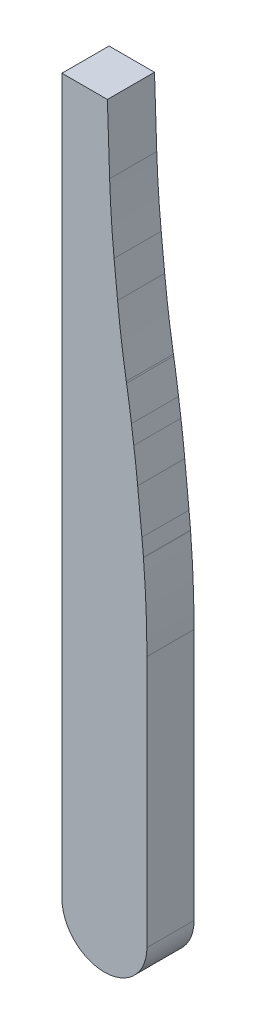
ISO-10303-21;
HEADER;
FILE_DESCRIPTION(('STEP AP214'),'2;1');
FILE_NAME('part.step','',(''),(''),'','','');
FILE_SCHEMA(('AUTOMOTIVE_DESIGN { 1 0 10303 214 1 1 1 1 }'));
ENDSEC;
DATA;
#1=APPLICATION_CONTEXT('core data for automotive mechanical design processes');
#2=APPLICATION_PROTOCOL_DEFINITION('international standard','automotive_design',2000,#1);
#3=PRODUCT_CONTEXT('',#1,'mechanical');
#4=PRODUCT('Part','Part','',(#3));
#5=PRODUCT_RELATED_PRODUCT_CATEGORY('part','',(#4));
#6=PRODUCT_DEFINITION_FORMATION('','',#4);
#7=PRODUCT_DEFINITION_CONTEXT('part definition',#1,'design');
#8=PRODUCT_DEFINITION('design','',#6,#7);
#9=PRODUCT_DEFINITION_SHAPE('','',#8);
#10=(LENGTH_UNIT() NAMED_UNIT(*) SI_UNIT(.MILLI.,.METRE.));
#11=(NAMED_UNIT(*) PLANE_ANGLE_UNIT() SI_UNIT($,.RADIAN.));
#12=(NAMED_UNIT(*) SI_UNIT($,.STERADIAN.) SOLID_ANGLE_UNIT());
#13=UNCERTAINTY_MEASURE_WITH_UNIT(LENGTH_MEASURE(1.E-05),#10,'distance_accuracy_value','');
#14=(GEOMETRIC_REPRESENTATION_CONTEXT(3) GLOBAL_UNCERTAINTY_ASSIGNED_CONTEXT((#13)) GLOBAL_UNIT_ASSIGNED_CONTEXT((#10,
#11,#12)) REPRESENTATION_CONTEXT('',''));
#15=CARTESIAN_POINT('',(0.,0.,0.));
#16=DIRECTION('',(0.,0.,1.));
#17=DIRECTION('',(1.,0.,0.));
#18=AXIS2_PLACEMENT_3D('',#15,#16,#17);
#19=CARTESIAN_POINT('',(-13.5,-200.065547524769,28.));
#20=DIRECTION('',(1.,0.,0.));
#21=DIRECTION('',(0.,0.,-1.));
#22=AXIS2_PLACEMENT_3D('',#19,#20,#21);
#23=PLANE('',#22);
#24=DIRECTION('',(0.,-1.,0.));
#25=VECTOR('',#24,1.);
#26=CARTESIAN_POINT('',(-13.5,-200.065547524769,0.));
#27=LINE('',#26,#25);
#28=CARTESIAN_POINT('',(-13.5,224.684452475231,0.));
#29=VERTEX_POINT('',#28);
#30=CARTESIAN_POINT('',(-13.5,-200.065547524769,0.));
#31=VERTEX_POINT('',#30);
#32=EDGE_CURVE('E170',#29,#31,#27,.T.);
#33=ORIENTED_EDGE('',*,*,#32,.T.);
#34=DIRECTION('',(0.,0.,-1.));
#35=VECTOR('',#34,1.);
#36=CARTESIAN_POINT('',(-13.5,-200.065547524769,28.));
#37=LINE('',#36,#35);
#38=CARTESIAN_POINT('',(-13.5,-200.065547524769,28.));
#39=VERTEX_POINT('',#38);
#40=EDGE_CURVE('E150',#39,#31,#37,.T.);
#41=ORIENTED_EDGE('',*,*,#40,.F.);
#42=DIRECTION('',(0.,-1.,0.));
#43=VECTOR('',#42,1.);
#44=CARTESIAN_POINT('',(-13.5,-200.065547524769,28.));
#45=LINE('',#44,#43);
#46=CARTESIAN_POINT('',(-13.5,224.684452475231,28.));
#47=VERTEX_POINT('',#46);
#48=EDGE_CURVE('E157',#47,#39,#45,.T.);
#49=ORIENTED_EDGE('',*,*,#48,.F.);
#50=DIRECTION('',(0.,0.,-1.));
#51=VECTOR('',#50,1.);
#52=CARTESIAN_POINT('',(-13.5,224.684452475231,28.));
#53=LINE('',#52,#51);
#54=EDGE_CURVE('E252',#47,#29,#53,.T.);
#55=ORIENTED_EDGE('',*,*,#54,.T.);
#56=EDGE_LOOP('',(#33,#41,#49,#55));
#57=FACE_BOUND('',#56,.T.);
#58=ADVANCED_FACE('F32',(#57),#23,.F.);
#59=CARTESIAN_POINT('',(11.75,-200.065547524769,28.));
#60=DIRECTION('',(0.,0.,-1.));
#61=DIRECTION('',(-1.,0.,0.));
#62=AXIS2_PLACEMENT_3D('',#59,#60,#61);
#63=CYLINDRICAL_SURFACE('',#62,25.25);
#64=CARTESIAN_POINT('',(11.75,-200.065547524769,0.));
#65=DIRECTION('',(0.,0.,1.));
#66=DIRECTION('',(1.,0.,0.));
#67=AXIS2_PLACEMENT_3D('',#64,#65,#66);
#68=CIRCLE('',#67,25.25);
#69=CARTESIAN_POINT('',(37.,-200.065547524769,0.));
#70=VERTEX_POINT('',#69);
#71=EDGE_CURVE('E259',#31,#70,#68,.T.);
#72=ORIENTED_EDGE('',*,*,#71,.T.);
#73=DIRECTION('',(0.,0.,-1.));
#74=VECTOR('',#73,1.);
#75=CARTESIAN_POINT('',(37.,-200.065547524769,28.));
#76=LINE('',#75,#74);
#77=CARTESIAN_POINT('',(37.,-200.065547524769,28.));
#78=VERTEX_POINT('',#77);
#79=EDGE_CURVE('E153',#78,#70,#76,.T.);
#80=ORIENTED_EDGE('',*,*,#79,.F.);
#81=CARTESIAN_POINT('',(11.75,-200.065547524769,28.));
#82=DIRECTION('',(0.,0.,1.));
#83=DIRECTION('',(1.,0.,0.));
#84=AXIS2_PLACEMENT_3D('',#81,#82,#83);
#85=CIRCLE('',#84,25.25);
#86=EDGE_CURVE('E146',#39,#78,#85,.T.);
#87=ORIENTED_EDGE('',*,*,#86,.F.);
#88=ORIENTED_EDGE('',*,*,#40,.T.);
#89=EDGE_LOOP('',(#72,#80,#87,#88));
#90=FACE_BOUND('',#89,.T.);
#91=ADVANCED_FACE('F148',(#90),#63,.T.);
#92=CARTESIAN_POINT('',(37.,-200.065547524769,28.));
#93=DIRECTION('',(-1.,0.,0.));
#94=DIRECTION('',(0.,0.,1.));
#95=AXIS2_PLACEMENT_3D('',#92,#93,#94);
#96=PLANE('',#95);
#97=DIRECTION('',(0.,1.,0.));
#98=VECTOR('',#97,1.);
#99=CARTESIAN_POINT('',(37.,-200.065547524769,0.));
#100=LINE('',#99,#98);
#101=CARTESIAN_POINT('',(37.,-50.2722948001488,0.));
#102=VERTEX_POINT('',#101);
#103=EDGE_CURVE('E261',#70,#102,#100,.T.);
#104=ORIENTED_EDGE('',*,*,#103,.T.);
#105=DIRECTION('',(0.,0.,-1.));
#106=VECTOR('',#105,1.);
#107=CARTESIAN_POINT('',(37.,-50.2722948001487,28.));
#108=LINE('',#107,#106);
#109=CARTESIAN_POINT('',(37.,-50.2722948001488,28.));
#110=VERTEX_POINT('',#109);
#111=EDGE_CURVE('E218',#102,#110,#108,.F.);
#112=ORIENTED_EDGE('',*,*,#111,.T.);
#113=DIRECTION('',(0.,1.,0.));
#114=VECTOR('',#113,1.);
#115=CARTESIAN_POINT('',(37.,-200.065547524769,28.));
#116=LINE('',#115,#114);
#117=EDGE_CURVE('E156',#78,#110,#116,.T.);
#118=ORIENTED_EDGE('',*,*,#117,.F.);
#119=ORIENTED_EDGE('',*,*,#79,.T.);
#120=EDGE_LOOP('',(#104,#112,#118,#119));
#121=FACE_BOUND('',#120,.T.);
#122=ADVANCED_FACE('F280',(#121),#96,.F.);
#123=CARTESIAN_POINT('',(34.5,4.68445247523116,28.));
#124=DIRECTION('',(-0.99654575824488,-0.0830454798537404,0.));
#125=DIRECTION('',(0.0830454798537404,-0.99654575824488,0.));
#126=AXIS2_PLACEMENT_3D('',#123,#124,#125);
#127=PLANE('',#126);
#128=DIRECTION('',(-0.0830454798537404,0.99654575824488,0.));
#129=VECTOR('',#128,1.);
#130=CARTESIAN_POINT('',(34.5,4.68445247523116,0.));
#131=LINE('',#130,#129);
#132=CARTESIAN_POINT('',(34.927454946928,-0.4450068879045,0.));
#133=VERTEX_POINT('',#132);
#134=CARTESIAN_POINT('',(34.9117676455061,-0.256759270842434,0.));
#135=VERTEX_POINT('',#134);
#136=EDGE_CURVE('E264',#133,#135,#131,.T.);
#137=ORIENTED_EDGE('',*,*,#136,.T.);
#138=DIRECTION('',(0.,0.,-1.));
#139=VECTOR('',#138,1.);
#140=CARTESIAN_POINT('',(34.9117676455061,-0.256759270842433,28.));
#141=LINE('',#140,#139);
#142=CARTESIAN_POINT('',(34.9117676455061,-0.256759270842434,28.));
#143=VERTEX_POINT('',#142);
#144=EDGE_CURVE('E216',#135,#143,#141,.F.);
#145=ORIENTED_EDGE('',*,*,#144,.T.);
#146=DIRECTION('',(-0.0830454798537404,0.99654575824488,0.));
#147=VECTOR('',#146,1.);
#148=CARTESIAN_POINT('',(34.5,4.68445247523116,28.));
#149=LINE('',#148,#147);
#150=CARTESIAN_POINT('',(34.927454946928,-0.4450068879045,28.));
#151=VERTEX_POINT('',#150);
#152=EDGE_CURVE('E283',#151,#143,#149,.T.);
#153=ORIENTED_EDGE('',*,*,#152,.F.);
#154=DIRECTION('',(0.,0.,-1.));
#155=VECTOR('',#154,1.);
#156=CARTESIAN_POINT('',(34.927454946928,-0.445006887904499,28.));
#157=LINE('',#156,#155);
#158=EDGE_CURVE('E213',#151,#133,#157,.T.);
#159=ORIENTED_EDGE('',*,*,#158,.T.);
#160=EDGE_LOOP('',(#137,#145,#153,#159));
#161=FACE_BOUND('',#160,.T.);
#162=ADVANCED_FACE('F319',(#161),#127,.F.);
#163=CARTESIAN_POINT('',(30.5,44.6844524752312,28.));
#164=DIRECTION('',(-0.995037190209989,-0.099503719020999,0.));
#165=DIRECTION('',(0.099503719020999,-0.995037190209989,0.));
#166=AXIS2_PLACEMENT_3D('',#163,#164,#165);
#167=PLANE('',#166);
#168=DIRECTION('',(-0.099503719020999,0.995037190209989,0.));
#169=VECTOR('',#168,1.);
#170=CARTESIAN_POINT('',(30.5,44.6844524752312,0.));
#171=LINE('',#170,#169);
#172=CARTESIAN_POINT('',(34.0066268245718,9.61818422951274,0.));
#173=VERTEX_POINT('',#172);
#174=CARTESIAN_POINT('',(31.4816791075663,34.8676613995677,0.));
#175=VERTEX_POINT('',#174);
#176=EDGE_CURVE('E267',#173,#175,#171,.T.);
#177=ORIENTED_EDGE('',*,*,#176,.T.);
#178=DIRECTION('',(0.,0.,-1.));
#179=VECTOR('',#178,1.);
#180=CARTESIAN_POINT('',(31.4816791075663,34.8676613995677,28.));
#181=LINE('',#180,#179);
#182=CARTESIAN_POINT('',(31.4816791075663,34.8676613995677,28.));
#183=VERTEX_POINT('',#182);
#184=EDGE_CURVE('E47',#175,#183,#181,.F.);
#185=ORIENTED_EDGE('',*,*,#184,.T.);
#186=DIRECTION('',(-0.099503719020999,0.995037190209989,0.));
#187=VECTOR('',#186,1.);
#188=CARTESIAN_POINT('',(30.5,44.6844524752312,28.));
#189=LINE('',#188,#187);
#190=CARTESIAN_POINT('',(34.0066268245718,9.61818422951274,28.));
#191=VERTEX_POINT('',#190);
#192=EDGE_CURVE('E285',#191,#183,#189,.T.);
#193=ORIENTED_EDGE('',*,*,#192,.F.);
#194=DIRECTION('',(0.,0.,-1.));
#195=VECTOR('',#194,1.);
#196=CARTESIAN_POINT('',(34.0066268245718,9.61818422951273,28.));
#197=LINE('',#196,#195);
#198=EDGE_CURVE('E209',#191,#173,#197,.T.);
#199=ORIENTED_EDGE('',*,*,#198,.T.);
#200=EDGE_LOOP('',(#177,#185,#193,#199));
#201=FACE_BOUND('',#200,.T.);
#202=ADVANCED_FACE('F312',(#201),#167,.F.);
#203=CARTESIAN_POINT('',(26.5,74.6844524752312,28.));
#204=DIRECTION('',(-0.991227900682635,-0.132163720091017,0.));
#205=DIRECTION('',(0.132163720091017,-0.991227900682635,0.));
#206=AXIS2_PLACEMENT_3D('',#203,#204,#205);
#207=PLANE('',#206);
#208=DIRECTION('',(-0.132163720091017,0.991227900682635,0.));
#209=VECTOR('',#208,1.);
#210=CARTESIAN_POINT('',(26.5,74.6844524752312,0.));
#211=LINE('',#210,#209);
#212=CARTESIAN_POINT('',(29.1961053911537,54.4636620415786,0.));
#213=VERTEX_POINT('',#212);
#214=CARTESIAN_POINT('',(27.7925624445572,64.9902341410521,0.));
#215=VERTEX_POINT('',#214);
#216=EDGE_CURVE('E269',#213,#215,#211,.T.);
#217=ORIENTED_EDGE('',*,*,#216,.T.);
#218=DIRECTION('',(0.,0.,-1.));
#219=VECTOR('',#218,1.);
#220=CARTESIAN_POINT('',(27.7925624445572,64.9902341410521,28.));
#221=LINE('',#220,#219);
#222=CARTESIAN_POINT('',(27.7925624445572,64.9902341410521,28.));
#223=VERTEX_POINT('',#222);
#224=EDGE_CURVE('E200',#215,#223,#221,.F.);
#225=ORIENTED_EDGE('',*,*,#224,.T.);
#226=DIRECTION('',(-0.132163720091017,0.991227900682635,0.));
#227=VECTOR('',#226,1.);
#228=CARTESIAN_POINT('',(26.5,74.6844524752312,28.));
#229=LINE('',#228,#227);
#230=CARTESIAN_POINT('',(29.1961053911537,54.4636620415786,28.));
#231=VERTEX_POINT('',#230);
#232=EDGE_CURVE('E289',#231,#223,#229,.T.);
#233=ORIENTED_EDGE('',*,*,#232,.F.);
#234=DIRECTION('',(0.,0.,-1.));
#235=VECTOR('',#234,1.);
#236=CARTESIAN_POINT('',(29.1961053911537,54.4636620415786,28.));
#237=LINE('',#236,#235);
#238=EDGE_CURVE('E197',#231,#213,#237,.T.);
#239=ORIENTED_EDGE('',*,*,#238,.T.);
#240=EDGE_LOOP('',(#217,#225,#233,#239));
#241=FACE_BOUND('',#240,.T.);
#242=ADVANCED_FACE('F305',(#241),#207,.F.);
#243=CARTESIAN_POINT('',(21.5,104.684452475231,28.));
#244=DIRECTION('',(-0.986393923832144,-0.164398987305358,0.));
#245=DIRECTION('',(0.164398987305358,-0.986393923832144,0.));
#246=AXIS2_PLACEMENT_3D('',#243,#244,#245);
#247=PLANE('',#246);
#248=DIRECTION('',(-0.164398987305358,0.986393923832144,0.));
#249=VECTOR('',#248,1.);
#250=CARTESIAN_POINT('',(21.5,104.684452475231,0.));
#251=LINE('',#250,#249);
#252=CARTESIAN_POINT('',(24.8921763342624,84.3313944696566,0.));
#253=VERTEX_POINT('',#252);
#254=CARTESIAN_POINT('',(24.7306093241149,85.3007965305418,0.));
#255=VERTEX_POINT('',#254);
#256=EDGE_CURVE('E240',#253,#255,#251,.T.);
#257=ORIENTED_EDGE('',*,*,#256,.T.);
#258=DIRECTION('',(0.,0.,-1.));
#259=VECTOR('',#258,1.);
#260=CARTESIAN_POINT('',(24.7306093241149,85.3007965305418,28.));
#261=LINE('',#260,#259);
#262=CARTESIAN_POINT('',(24.7306093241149,85.3007965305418,28.));
#263=VERTEX_POINT('',#262);
#264=EDGE_CURVE('E184',#255,#263,#261,.F.);
#265=ORIENTED_EDGE('',*,*,#264,.T.);
#266=DIRECTION('',(-0.164398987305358,0.986393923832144,0.));
#267=VECTOR('',#266,1.);
#268=CARTESIAN_POINT('',(21.5,104.684452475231,28.));
#269=LINE('',#268,#267);
#270=CARTESIAN_POINT('',(24.8921763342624,84.3313944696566,28.));
#271=VERTEX_POINT('',#270);
#272=EDGE_CURVE('E254',#271,#263,#269,.T.);
#273=ORIENTED_EDGE('',*,*,#272,.F.);
#274=DIRECTION('',(0.,0.,-1.));
#275=VECTOR('',#274,1.);
#276=CARTESIAN_POINT('',(24.8921763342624,84.3313944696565,28.));
#277=LINE('',#276,#275);
#278=EDGE_CURVE('E181',#271,#253,#277,.T.);
#279=ORIENTED_EDGE('',*,*,#278,.T.);
#280=EDGE_LOOP('',(#257,#265,#273,#279));
#281=FACE_BOUND('',#280,.T.);
#282=ADVANCED_FACE('F299',(#281),#247,.F.);
#283=CARTESIAN_POINT('',(15.5,164.684452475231,28.));
#284=DIRECTION('',(-0.995037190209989,-0.0995037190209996,0.));
#285=DIRECTION('',(0.0995037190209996,-0.995037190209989,0.));
#286=AXIS2_PLACEMENT_3D('',#283,#284,#285);
#287=PLANE('',#286);
#288=DIRECTION('',(-0.0995037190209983,0.995037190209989,0.));
#289=VECTOR('',#288,1.);
#290=CARTESIAN_POINT('',(18.5,134.684452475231,28.));
#291=LINE('',#290,#289);
#292=CARTESIAN_POINT('',(19.5446494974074,124.237957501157,28.));
#293=VERTEX_POINT('',#292);
#294=CARTESIAN_POINT('',(17.4812784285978,144.871668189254,28.));
#295=VERTEX_POINT('',#294);
#296=EDGE_CURVE('E247',#293,#295,#291,.T.);
#297=ORIENTED_EDGE('',*,*,#296,.F.);
#298=DIRECTION('',(0.,0.,-1.));
#299=VECTOR('',#298,1.);
#300=CARTESIAN_POINT('',(19.5446494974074,124.237957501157,0.));
#301=LINE('',#300,#299);
#302=CARTESIAN_POINT('',(19.5446494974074,124.237957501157,0.));
#303=VERTEX_POINT('',#302);
#304=EDGE_CURVE('E173',#293,#303,#301,.T.);
#305=ORIENTED_EDGE('',*,*,#304,.T.);
#306=DIRECTION('',(-0.0995037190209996,0.995037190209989,0.));
#307=VECTOR('',#306,1.);
#308=CARTESIAN_POINT('',(15.5,164.684452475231,0.));
#309=LINE('',#308,#307);
#310=CARTESIAN_POINT('',(17.4812784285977,144.871668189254,0.));
#311=VERTEX_POINT('',#310);
#312=EDGE_CURVE('E229',#303,#311,#309,.T.);
#313=ORIENTED_EDGE('',*,*,#312,.T.);
#314=DIRECTION('',(0.,0.,-1.));
#315=VECTOR('',#314,1.);
#316=CARTESIAN_POINT('',(17.4812784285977,144.871668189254,28.));
#317=LINE('',#316,#315);
#318=EDGE_CURVE('E171',#311,#295,#317,.F.);
#319=ORIENTED_EDGE('',*,*,#318,.T.);
#320=EDGE_LOOP('',(#297,#305,#313,#319));
#321=FACE_BOUND('',#320,.T.);
#322=ADVANCED_FACE('F237',(#321),#287,.F.);
#323=CARTESIAN_POINT('',(13.5,224.684452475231,28.));
#324=DIRECTION('',(-0.999444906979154,-0.0333148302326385,0.));
#325=DIRECTION('',(0.0333148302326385,-0.999444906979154,0.));
#326=AXIS2_PLACEMENT_3D('',#323,#324,#325);
#327=PLANE('',#326);
#328=DIRECTION('',(-0.0333148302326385,0.999444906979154,0.));
#329=VECTOR('',#328,1.);
#330=CARTESIAN_POINT('',(13.5,224.684452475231,28.));
#331=LINE('',#330,#329);
#332=CARTESIAN_POINT('',(14.8366483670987,184.58500146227,28.));
#333=VERTEX_POINT('',#332);
#334=CARTESIAN_POINT('',(13.5,224.684452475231,28.));
#335=VERTEX_POINT('',#334);
#336=EDGE_CURVE('E245',#333,#335,#331,.T.);
#337=ORIENTED_EDGE('',*,*,#336,.F.);
#338=DIRECTION('',(0.,0.,-1.));
#339=VECTOR('',#338,1.);
#340=CARTESIAN_POINT('',(14.8366483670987,184.58500146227,0.));
#341=LINE('',#340,#339);
#342=CARTESIAN_POINT('',(14.8366483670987,184.58500146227,0.));
#343=VERTEX_POINT('',#342);
#344=EDGE_CURVE('E186',#333,#343,#341,.T.);
#345=ORIENTED_EDGE('',*,*,#344,.T.);
#346=DIRECTION('',(-0.0333148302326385,0.999444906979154,0.));
#347=VECTOR('',#346,1.);
#348=CARTESIAN_POINT('',(13.5,224.684452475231,0.));
#349=LINE('',#348,#347);
#350=CARTESIAN_POINT('',(13.5,224.684452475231,0.));
#351=VERTEX_POINT('',#350);
#352=EDGE_CURVE('E231',#343,#351,#349,.T.);
#353=ORIENTED_EDGE('',*,*,#352,.T.);
#354=DIRECTION('',(0.,0.,-1.));
#355=VECTOR('',#354,1.);
#356=CARTESIAN_POINT('',(13.5,224.684452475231,28.));
#357=LINE('',#356,#355);
#358=EDGE_CURVE('E175',#335,#351,#357,.T.);
#359=ORIENTED_EDGE('',*,*,#358,.F.);
#360=EDGE_LOOP('',(#337,#345,#353,#359));
#361=FACE_BOUND('',#360,.T.);
#362=ADVANCED_FACE('F249',(#361),#327,.F.);
#363=CARTESIAN_POINT('',(13.5,224.684452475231,28.));
#364=DIRECTION('',(0.,-1.,0.));
#365=DIRECTION('',(0.,0.,-1.));
#366=AXIS2_PLACEMENT_3D('',#363,#364,#365);
#367=PLANE('',#366);
#368=DIRECTION('',(-1.,0.,0.));
#369=VECTOR('',#368,1.);
#370=CARTESIAN_POINT('',(13.5,224.684452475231,0.));
#371=LINE('',#370,#369);
#372=EDGE_CURVE('E167',#351,#29,#371,.T.);
#373=ORIENTED_EDGE('',*,*,#372,.T.);
#374=ORIENTED_EDGE('',*,*,#54,.F.);
#375=DIRECTION('',(-1.,0.,0.));
#376=VECTOR('',#375,1.);
#377=CARTESIAN_POINT('',(13.5,224.684452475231,28.));
#378=LINE('',#377,#376);
#379=EDGE_CURVE('E163',#335,#47,#378,.T.);
#380=ORIENTED_EDGE('',*,*,#379,.F.);
#381=ORIENTED_EDGE('',*,*,#358,.T.);
#382=EDGE_LOOP('',(#373,#374,#380,#381));
#383=FACE_BOUND('',#382,.T.);
#384=ADVANCED_FACE('F277',(#383),#367,.F.);
#385=CARTESIAN_POINT('',(11.75,-200.065547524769,28.));
#386=DIRECTION('',(0.,0.,1.));
#387=DIRECTION('',(1.,0.,0.));
#388=AXIS2_PLACEMENT_3D('',#385,#386,#387);
#389=PLANE('',#388);
#390=ORIENTED_EDGE('',*,*,#232,.T.);
#391=CARTESIAN_POINT('',(-566.944177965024,-14.3079979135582,28.));
#392=DIRECTION('',(0.,0.,1.));
#393=DIRECTION('',(1.,0.,0.));
#394=AXIS2_PLACEMENT_3D('',#391,#392,#393);
#395=CIRCLE('',#394,600.);
#396=EDGE_CURVE('E207',#223,#271,#395,.T.);
#397=ORIENTED_EDGE('',*,*,#396,.T.);
#398=ORIENTED_EDGE('',*,*,#272,.T.);
#399=CARTESIAN_POINT('',(616.566963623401,183.940188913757,28.));
#400=DIRECTION('',(0.,0.,1.));
#401=DIRECTION('',(1.,0.,0.));
#402=AXIS2_PLACEMENT_3D('',#399,#400,#401);
#403=CIRCLE('',#402,600.);
#404=EDGE_CURVE('E222',#263,#293,#403,.F.);
#405=ORIENTED_EDGE('',*,*,#404,.T.);
#406=ORIENTED_EDGE('',*,*,#296,.T.);
#407=CARTESIAN_POINT('',(614.503592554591,204.573899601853,28.));
#408=DIRECTION('',(0.,0.,1.));
#409=DIRECTION('',(1.,0.,0.));
#410=AXIS2_PLACEMENT_3D('',#407,#408,#409);
#411=CIRCLE('',#410,600.);
#412=EDGE_CURVE('E11',#295,#333,#411,.F.);
#413=ORIENTED_EDGE('',*,*,#412,.T.);
#414=ORIENTED_EDGE('',*,*,#336,.T.);
#415=ORIENTED_EDGE('',*,*,#379,.T.);
#416=ORIENTED_EDGE('',*,*,#48,.T.);
#417=ORIENTED_EDGE('',*,*,#86,.T.);
#418=ORIENTED_EDGE('',*,*,#117,.T.);
#419=CARTESIAN_POINT('',(-563.,-50.2722948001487,28.));
#420=DIRECTION('',(0.,0.,1.));
#421=DIRECTION('',(1.,0.,0.));
#422=AXIS2_PLACEMENT_3D('',#419,#420,#421);
#423=CIRCLE('',#422,600.);
#424=EDGE_CURVE('E202',#110,#151,#423,.T.);
#425=ORIENTED_EDGE('',*,*,#424,.T.);
#426=ORIENTED_EDGE('',*,*,#152,.T.);
#427=CARTESIAN_POINT('',(-563.015687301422,-50.0840471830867,28.));
#428=DIRECTION('',(0.,0.,1.));
#429=DIRECTION('',(1.,0.,0.));
#430=AXIS2_PLACEMENT_3D('',#427,#428,#429);
#431=CIRCLE('',#430,600.);
#432=EDGE_CURVE('E54',#143,#191,#431,.T.);
#433=ORIENTED_EDGE('',*,*,#432,.T.);
#434=ORIENTED_EDGE('',*,*,#192,.T.);
#435=CARTESIAN_POINT('',(-565.540635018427,-24.8345700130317,28.));
#436=DIRECTION('',(0.,0.,1.));
#437=DIRECTION('',(1.,0.,0.));
#438=AXIS2_PLACEMENT_3D('',#435,#436,#437);
#439=CIRCLE('',#438,600.);
#440=EDGE_CURVE('E205',#183,#231,#439,.T.);
#441=ORIENTED_EDGE('',*,*,#440,.T.);
#442=EDGE_LOOP('',(#390,#397,#398,#405,#406,#413,#414,#415,#416,#417,#418,#425,#426,#433,#434,#441));
#443=FACE_BOUND('',#442,.T.);
#444=ADVANCED_FACE('F161',(#443),#389,.T.);
#445=CARTESIAN_POINT('',(11.75,-200.065547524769,0.));
#446=DIRECTION('',(0.,0.,1.));
#447=DIRECTION('',(1.,0.,0.));
#448=AXIS2_PLACEMENT_3D('',#445,#446,#447);
#449=PLANE('',#448);
#450=ORIENTED_EDGE('',*,*,#256,.F.);
#451=CARTESIAN_POINT('',(-566.944177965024,-14.3079979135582,0.));
#452=DIRECTION('',(0.,0.,1.));
#453=DIRECTION('',(1.,0.,0.));
#454=AXIS2_PLACEMENT_3D('',#451,#452,#453);
#455=CIRCLE('',#454,600.);
#456=EDGE_CURVE('E195',#253,#215,#455,.F.);
#457=ORIENTED_EDGE('',*,*,#456,.T.);
#458=ORIENTED_EDGE('',*,*,#216,.F.);
#459=CARTESIAN_POINT('',(-565.540635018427,-24.8345700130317,0.));
#460=DIRECTION('',(0.,0.,1.));
#461=DIRECTION('',(1.,0.,0.));
#462=AXIS2_PLACEMENT_3D('',#459,#460,#461);
#463=CIRCLE('',#462,600.);
#464=EDGE_CURVE('E193',#213,#175,#463,.F.);
#465=ORIENTED_EDGE('',*,*,#464,.T.);
#466=ORIENTED_EDGE('',*,*,#176,.F.);
#467=CARTESIAN_POINT('',(-563.015687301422,-50.0840471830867,0.));
#468=DIRECTION('',(0.,0.,1.));
#469=DIRECTION('',(1.,0.,0.));
#470=AXIS2_PLACEMENT_3D('',#467,#468,#469);
#471=CIRCLE('',#470,600.);
#472=EDGE_CURVE('E191',#173,#135,#471,.F.);
#473=ORIENTED_EDGE('',*,*,#472,.T.);
#474=ORIENTED_EDGE('',*,*,#136,.F.);
#475=CARTESIAN_POINT('',(-563.,-50.2722948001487,0.));
#476=DIRECTION('',(0.,0.,1.));
#477=DIRECTION('',(1.,0.,0.));
#478=AXIS2_PLACEMENT_3D('',#475,#476,#477);
#479=CIRCLE('',#478,600.);
#480=EDGE_CURVE('E189',#133,#102,#479,.F.);
#481=ORIENTED_EDGE('',*,*,#480,.T.);
#482=ORIENTED_EDGE('',*,*,#103,.F.);
#483=ORIENTED_EDGE('',*,*,#71,.F.);
#484=ORIENTED_EDGE('',*,*,#32,.F.);
#485=ORIENTED_EDGE('',*,*,#372,.F.);
#486=ORIENTED_EDGE('',*,*,#352,.F.);
#487=CARTESIAN_POINT('',(614.503592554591,204.573899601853,0.));
#488=DIRECTION('',(0.,0.,1.));
#489=DIRECTION('',(1.,0.,0.));
#490=AXIS2_PLACEMENT_3D('',#487,#488,#489);
#491=CIRCLE('',#490,600.);
#492=EDGE_CURVE('E40',#343,#311,#491,.T.);
#493=ORIENTED_EDGE('',*,*,#492,.T.);
#494=ORIENTED_EDGE('',*,*,#312,.F.);
#495=CARTESIAN_POINT('',(616.566963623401,183.940188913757,0.));
#496=DIRECTION('',(0.,0.,1.));
#497=DIRECTION('',(1.,0.,0.));
#498=AXIS2_PLACEMENT_3D('',#495,#496,#497);
#499=CIRCLE('',#498,600.);
#500=EDGE_CURVE('E220',#303,#255,#499,.T.);
#501=ORIENTED_EDGE('',*,*,#500,.T.);
#502=EDGE_LOOP('',(#450,#457,#458,#465,#466,#473,#474,#481,#482,#483,#484,#485,#486,#493,#494,#501));
#503=FACE_BOUND('',#502,.T.);
#504=ADVANCED_FACE('F228',(#503),#449,.F.);
#505=CARTESIAN_POINT('',(616.566963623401,183.940188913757,28.));
#506=DIRECTION('',(0.,0.,1.));
#507=DIRECTION('',(1.,0.,0.));
#508=AXIS2_PLACEMENT_3D('',#505,#506,#507);
#509=CYLINDRICAL_SURFACE('',#508,600.);
#510=ORIENTED_EDGE('',*,*,#404,.F.);
#511=ORIENTED_EDGE('',*,*,#264,.F.);
#512=ORIENTED_EDGE('',*,*,#500,.F.);
#513=ORIENTED_EDGE('',*,*,#304,.F.);
#514=EDGE_LOOP('',(#510,#511,#512,#513));
#515=FACE_BOUND('',#514,.T.);
#516=ADVANCED_FACE('F298',(#515),#509,.F.);
#517=CARTESIAN_POINT('',(614.503592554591,204.573899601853,28.));
#518=DIRECTION('',(0.,0.,1.));
#519=DIRECTION('',(1.,0.,0.));
#520=AXIS2_PLACEMENT_3D('',#517,#518,#519);
#521=CYLINDRICAL_SURFACE('',#520,600.);
#522=ORIENTED_EDGE('',*,*,#412,.F.);
#523=ORIENTED_EDGE('',*,*,#318,.F.);
#524=ORIENTED_EDGE('',*,*,#492,.F.);
#525=ORIENTED_EDGE('',*,*,#344,.F.);
#526=EDGE_LOOP('',(#522,#523,#524,#525));
#527=FACE_BOUND('',#526,.T.);
#528=ADVANCED_FACE('F243',(#527),#521,.F.);
#529=CARTESIAN_POINT('',(-566.944177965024,-14.3079979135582,28.));
#530=DIRECTION('',(0.,0.,-1.));
#531=DIRECTION('',(-1.,0.,0.));
#532=AXIS2_PLACEMENT_3D('',#529,#530,#531);
#533=CYLINDRICAL_SURFACE('',#532,600.);
#534=ORIENTED_EDGE('',*,*,#396,.F.);
#535=ORIENTED_EDGE('',*,*,#224,.F.);
#536=ORIENTED_EDGE('',*,*,#456,.F.);
#537=ORIENTED_EDGE('',*,*,#278,.F.);
#538=EDGE_LOOP('',(#534,#535,#536,#537));
#539=FACE_BOUND('',#538,.T.);
#540=ADVANCED_FACE('F301',(#539),#533,.T.);
#541=CARTESIAN_POINT('',(-565.540635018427,-24.8345700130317,28.));
#542=DIRECTION('',(0.,0.,-1.));
#543=DIRECTION('',(-1.,0.,0.));
#544=AXIS2_PLACEMENT_3D('',#541,#542,#543);
#545=CYLINDRICAL_SURFACE('',#544,600.);
#546=ORIENTED_EDGE('',*,*,#440,.F.);
#547=ORIENTED_EDGE('',*,*,#184,.F.);
#548=ORIENTED_EDGE('',*,*,#464,.F.);
#549=ORIENTED_EDGE('',*,*,#238,.F.);
#550=EDGE_LOOP('',(#546,#547,#548,#549));
#551=FACE_BOUND('',#550,.T.);
#552=ADVANCED_FACE('F310',(#551),#545,.T.);
#553=CARTESIAN_POINT('',(-563.015687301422,-50.0840471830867,28.));
#554=DIRECTION('',(0.,0.,-1.));
#555=DIRECTION('',(-1.,0.,0.));
#556=AXIS2_PLACEMENT_3D('',#553,#554,#555);
#557=CYLINDRICAL_SURFACE('',#556,600.);
#558=ORIENTED_EDGE('',*,*,#432,.F.);
#559=ORIENTED_EDGE('',*,*,#144,.F.);
#560=ORIENTED_EDGE('',*,*,#472,.F.);
#561=ORIENTED_EDGE('',*,*,#198,.F.);
#562=EDGE_LOOP('',(#558,#559,#560,#561));
#563=FACE_BOUND('',#562,.T.);
#564=ADVANCED_FACE('F315',(#563),#557,.T.);
#565=CARTESIAN_POINT('',(-563.,-50.2722948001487,28.));
#566=DIRECTION('',(0.,0.,-1.));
#567=DIRECTION('',(-1.,0.,0.));
#568=AXIS2_PLACEMENT_3D('',#565,#566,#567);
#569=CYLINDRICAL_SURFACE('',#568,600.);
#570=ORIENTED_EDGE('',*,*,#424,.F.);
#571=ORIENTED_EDGE('',*,*,#111,.F.);
#572=ORIENTED_EDGE('',*,*,#480,.F.);
#573=ORIENTED_EDGE('',*,*,#158,.F.);
#574=EDGE_LOOP('',(#570,#571,#572,#573));
#575=FACE_BOUND('',#574,.T.);
#576=ADVANCED_FACE('F34',(#575),#569,.T.);
#577=CLOSED_SHELL('',(#58,#91,#122,#162,#202,#242,#282,#322,#362,#384,#444,#504,#516,#528,#540,
#552,#564,#576));
#578=MANIFOLD_SOLID_BREP('B2',#577);
#579=ADVANCED_BREP_SHAPE_REPRESENTATION('',(#18,#578),#14);
#580=SHAPE_DEFINITION_REPRESENTATION(#9,#579);
ENDSEC;
END-ISO-10303-21;
